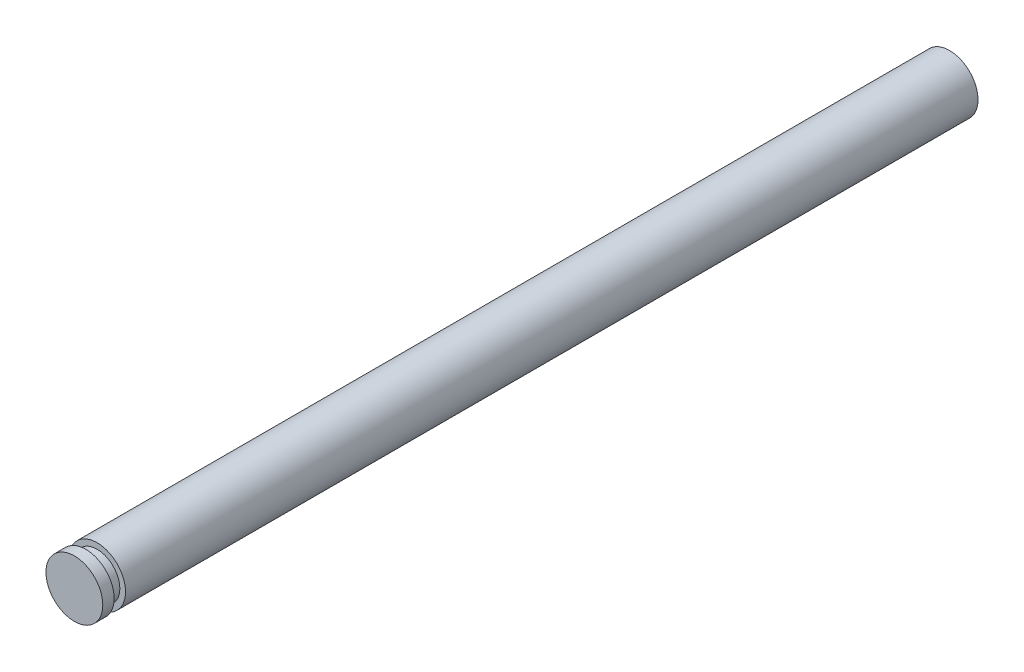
from build123d import *

# Parameters (mm, degrees)
EXTRUDE_1_DEPTH      = 2
EXTRUDE_1_DEPTH_BACK = 75
SKETCH_1_R           = 2.5
SKETCH_2_R           = 3.210171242
SKETCH_2_R_2         = 2
CUT_EXTRUDE_1_DEPTH  = 1


with BuildPart() as part:
    # Sketch 1 → Extrude 1 (new, two sides: drawn at the far end of the back side and taken through both)
    with BuildSketch(Plane.XY.offset(-EXTRUDE_1_DEPTH_BACK)):
        Circle(SKETCH_1_R)
    extrude(amount=EXTRUDE_1_DEPTH + EXTRUDE_1_DEPTH_BACK)

    # Sketch 2 → Cut-Extrude 1 (cut)
    with BuildSketch(Plane.XY.offset(1)):
        Circle(SKETCH_2_R)
        Circle(SKETCH_2_R_2, mode=Mode.SUBTRACT)
    extrude(amount=-CUT_EXTRUDE_1_DEPTH, mode=Mode.SUBTRACT)


solid = part.part
